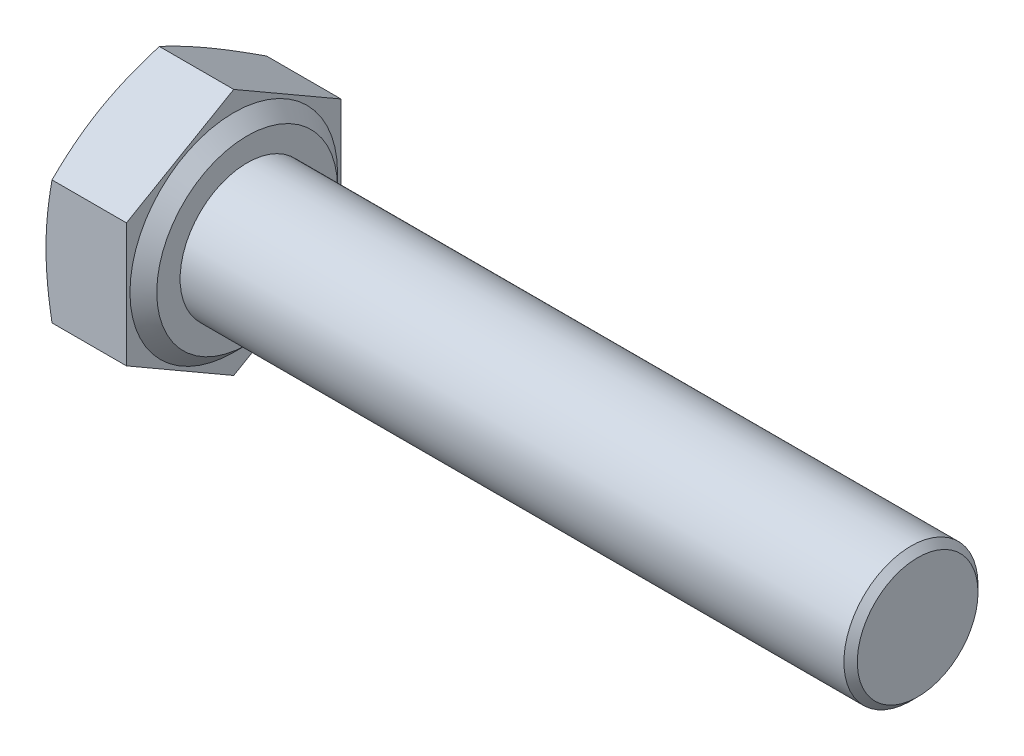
ISO-10303-21;
HEADER;
FILE_DESCRIPTION(('STEP AP214'),'2;1');
FILE_NAME('part.step','',(''),(''),'','','');
FILE_SCHEMA(('AUTOMOTIVE_DESIGN { 1 0 10303 214 1 1 1 1 }'));
ENDSEC;
DATA;
#1=APPLICATION_CONTEXT('core data for automotive mechanical design processes');
#2=APPLICATION_PROTOCOL_DEFINITION('international standard','automotive_design',2000,#1);
#3=PRODUCT_CONTEXT('',#1,'mechanical');
#4=PRODUCT('Part','Part','',(#3));
#5=PRODUCT_RELATED_PRODUCT_CATEGORY('part','',(#4));
#6=PRODUCT_DEFINITION_FORMATION('','',#4);
#7=PRODUCT_DEFINITION_CONTEXT('part definition',#1,'design');
#8=PRODUCT_DEFINITION('design','',#6,#7);
#9=PRODUCT_DEFINITION_SHAPE('','',#8);
#10=(LENGTH_UNIT() NAMED_UNIT(*) SI_UNIT(.MILLI.,.METRE.));
#11=(NAMED_UNIT(*) PLANE_ANGLE_UNIT() SI_UNIT($,.RADIAN.));
#12=(NAMED_UNIT(*) SI_UNIT($,.STERADIAN.) SOLID_ANGLE_UNIT());
#13=UNCERTAINTY_MEASURE_WITH_UNIT(LENGTH_MEASURE(1.E-05),#10,'distance_accuracy_value','');
#14=(GEOMETRIC_REPRESENTATION_CONTEXT(3) GLOBAL_UNCERTAINTY_ASSIGNED_CONTEXT((#13)) GLOBAL_UNIT_ASSIGNED_CONTEXT((#10,
#11,#12)) REPRESENTATION_CONTEXT('',''));
#15=CARTESIAN_POINT('',(0.,0.,0.));
#16=DIRECTION('',(0.,0.,1.));
#17=DIRECTION('',(1.,0.,0.));
#18=AXIS2_PLACEMENT_3D('',#15,#16,#17);
#19=CARTESIAN_POINT('',(3.5,-4.61880215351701,0.));
#20=DIRECTION('',(1.,0.,0.));
#21=DIRECTION('',(0.,0.,-1.));
#22=AXIS2_PLACEMENT_3D('',#19,#20,#21);
#23=PLANE('',#22);
#24=CARTESIAN_POINT('',(3.5,0.,0.));
#25=DIRECTION('',(-1.,0.,0.));
#26=DIRECTION('',(0.,0.,1.));
#27=AXIS2_PLACEMENT_3D('',#24,#25,#26);
#28=CIRCLE('',#27,3.37);
#29=CARTESIAN_POINT('',(3.5,0.,3.37));
#30=VERTEX_POINT('',#29);
#31=EDGE_CURVE('E254',#30,#30,#28,.T.);
#32=ORIENTED_EDGE('',*,*,#31,.F.);
#33=EDGE_LOOP('',(#32));
#34=FACE_BOUND('',#33,.T.);
#35=CARTESIAN_POINT('',(3.5,0.,0.));
#36=DIRECTION('',(1.,0.,0.));
#37=DIRECTION('',(0.,0.,-1.));
#38=AXIS2_PLACEMENT_3D('',#35,#36,#37);
#39=CIRCLE('',#38,2.5);
#40=CARTESIAN_POINT('',(3.5,0.,-2.5));
#41=VERTEX_POINT('',#40);
#42=EDGE_CURVE('E272',#41,#41,#39,.T.);
#43=ORIENTED_EDGE('',*,*,#42,.F.);
#44=EDGE_LOOP('',(#43));
#45=FACE_BOUND('',#44,.T.);
#46=ADVANCED_FACE('F32',(#34,#45),#23,.T.);
#47=CARTESIAN_POINT('',(3.5,-2.3094010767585,4.));
#48=DIRECTION('',(0.,0.866025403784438,-0.5));
#49=DIRECTION('',(0.,0.5,0.866025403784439));
#50=AXIS2_PLACEMENT_3D('',#47,#48,#49);
#51=PLANE('',#50);
#52=CARTESIAN_POINT('',(0.225267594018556,-4.61891762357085,-0.000199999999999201));
#53=CARTESIAN_POINT('',(0.190440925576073,-4.52327074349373,0.165465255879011));
#54=CARTESIAN_POINT('',(0.158759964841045,-4.42730844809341,0.331676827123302));
#55=CARTESIAN_POINT('',(0.103022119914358,-4.23475986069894,0.66518076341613));
#56=CARTESIAN_POINT('',(0.0789712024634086,-4.1381731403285,0.832473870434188));
#57=CARTESIAN_POINT('',(0.040069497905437,-3.9454476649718,1.16628418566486));
#58=CARTESIAN_POINT('',(0.0251338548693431,-3.84931331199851,1.33279376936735));
#59=CARTESIAN_POINT('',(0.00510095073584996,-3.65681977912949,1.66620234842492));
#60=CARTESIAN_POINT('',(0.,-3.56046069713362,1.83310117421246));
#61=CARTESIAN_POINT('',(0.,-3.36774253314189,2.16689882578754));
#62=CARTESIAN_POINT('',(0.00510095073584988,-3.27138345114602,2.33379765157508));
#63=CARTESIAN_POINT('',(0.025133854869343,-3.078889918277,2.66720623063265));
#64=CARTESIAN_POINT('',(0.0400694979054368,-2.98275556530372,2.83371581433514));
#65=CARTESIAN_POINT('',(0.0789712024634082,-2.79003008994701,3.16752612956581));
#66=CARTESIAN_POINT('',(0.103022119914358,-2.69344336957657,3.33481923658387));
#67=CARTESIAN_POINT('',(0.158759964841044,-2.5008947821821,3.6683231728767));
#68=CARTESIAN_POINT('',(0.190440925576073,-2.40493248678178,3.83453474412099));
#69=CARTESIAN_POINT('',(0.225267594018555,-2.30928560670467,4.0002));
#70=B_SPLINE_CURVE_WITH_KNOTS('',3,(#52,#53,#54,#55,#56,#57,#58,#59,#60,#61,#62,#63,#64,#65,#66,
#67,#68,#69),.UNSPECIFIED.,.F.,.F.,(4,2,2,2,2,2,2,2,4),(0.,0.583374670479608,1.16720442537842,
1.74551281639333,2.32360420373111,2.90169559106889,3.4800039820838,4.06383373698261,
4.64720840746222),.UNSPECIFIED.);
#71=CARTESIAN_POINT('',(0.225225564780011,-4.61880215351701,0.));
#72=VERTEX_POINT('',#71);
#73=CARTESIAN_POINT('',(0.,-3.46410161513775,2.));
#74=VERTEX_POINT('',#73);
#75=EDGE_CURVE('E166',#72,#74,#70,.T.);
#76=ORIENTED_EDGE('',*,*,#75,.F.);
#77=DIRECTION('',(-1.,0.,0.));
#78=VECTOR('',#77,1.);
#79=CARTESIAN_POINT('',(3.5,-4.61880215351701,0.));
#80=LINE('',#79,#78);
#81=CARTESIAN_POINT('',(3.,-4.61880215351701,0.));
#82=VERTEX_POINT('',#81);
#83=EDGE_CURVE('E141',#82,#72,#80,.T.);
#84=ORIENTED_EDGE('',*,*,#83,.F.);
#85=DIRECTION('',(0.,-0.5,-0.866025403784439));
#86=VECTOR('',#85,1.);
#87=CARTESIAN_POINT('',(3.,-2.3094010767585,4.));
#88=LINE('',#87,#86);
#89=CARTESIAN_POINT('',(3.,-2.3094010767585,4.));
#90=VERTEX_POINT('',#89);
#91=EDGE_CURVE('E132',#90,#82,#88,.T.);
#92=ORIENTED_EDGE('',*,*,#91,.F.);
#93=DIRECTION('',(-1.,0.,0.));
#94=VECTOR('',#93,1.);
#95=CARTESIAN_POINT('',(3.5,-2.3094010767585,4.));
#96=LINE('',#95,#94);
#97=CARTESIAN_POINT('',(0.225225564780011,-2.3094010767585,4.));
#98=VERTEX_POINT('',#97);
#99=EDGE_CURVE('E127',#90,#98,#96,.T.);
#100=ORIENTED_EDGE('',*,*,#99,.T.);
#101=EDGE_CURVE('E120',#74,#98,#70,.T.);
#102=ORIENTED_EDGE('',*,*,#101,.F.);
#103=EDGE_LOOP('',(#76,#84,#92,#100,#102));
#104=FACE_BOUND('',#103,.T.);
#105=ADVANCED_FACE('F229',(#104),#51,.F.);
#106=CARTESIAN_POINT('',(3.5,-4.61880215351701,0.));
#107=DIRECTION('',(0.,0.866025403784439,0.5));
#108=DIRECTION('',(0.,-0.5,0.866025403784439));
#109=AXIS2_PLACEMENT_3D('',#106,#107,#108);
#110=PLANE('',#109);
#111=CARTESIAN_POINT('',(0.225267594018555,-2.30928560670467,-4.0002));
#112=CARTESIAN_POINT('',(0.190440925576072,-2.40493248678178,-3.83453474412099));
#113=CARTESIAN_POINT('',(0.158759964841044,-2.50089478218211,-3.6683231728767));
#114=CARTESIAN_POINT('',(0.103022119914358,-2.69344336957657,-3.33481923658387));
#115=CARTESIAN_POINT('',(0.0789712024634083,-2.79003008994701,-3.16752612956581));
#116=CARTESIAN_POINT('',(0.0400694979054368,-2.98275556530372,-2.83371581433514));
#117=CARTESIAN_POINT('',(0.0251338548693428,-3.078889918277,-2.66720623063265));
#118=CARTESIAN_POINT('',(0.00510095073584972,-3.27138345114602,-2.33379765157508));
#119=CARTESIAN_POINT('',(0.,-3.36774253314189,-2.16689882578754));
#120=CARTESIAN_POINT('',(0.,-3.56046069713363,-1.83310117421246));
#121=CARTESIAN_POINT('',(0.00510095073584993,-3.65681977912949,-1.66620234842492));
#122=CARTESIAN_POINT('',(0.0251338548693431,-3.84931331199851,-1.33279376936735));
#123=CARTESIAN_POINT('',(0.0400694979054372,-3.9454476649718,-1.16628418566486));
#124=CARTESIAN_POINT('',(0.0789712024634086,-4.1381731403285,-0.832473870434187));
#125=CARTESIAN_POINT('',(0.103022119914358,-4.23475986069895,-0.665180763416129));
#126=CARTESIAN_POINT('',(0.158759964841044,-4.42730844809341,-0.331676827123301));
#127=CARTESIAN_POINT('',(0.190440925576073,-4.52327074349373,-0.16546525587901));
#128=CARTESIAN_POINT('',(0.225267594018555,-4.61891762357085,0.000200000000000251));
#129=B_SPLINE_CURVE_WITH_KNOTS('',3,(#111,#112,#113,#114,#115,#116,#117,#118,#119,#120,#121,
#122,#123,#124,#125,#126,#127,#128),.UNSPECIFIED.,.F.,.F.,(4,2,2,2,2,2,2,2,4),(0.,
0.583374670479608,1.16720442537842,1.74551281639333,2.32360420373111,2.90169559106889,
3.4800039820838,4.06383373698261,4.64720840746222),.UNSPECIFIED.);
#130=CARTESIAN_POINT('',(0.225225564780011,-2.3094010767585,-4.));
#131=VERTEX_POINT('',#130);
#132=CARTESIAN_POINT('',(0.,-3.46410161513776,-2.));
#133=VERTEX_POINT('',#132);
#134=EDGE_CURVE('E172',#131,#133,#129,.T.);
#135=ORIENTED_EDGE('',*,*,#134,.F.);
#136=DIRECTION('',(-1.,0.,0.));
#137=VECTOR('',#136,1.);
#138=CARTESIAN_POINT('',(3.5,-2.30940107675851,-4.));
#139=LINE('',#138,#137);
#140=CARTESIAN_POINT('',(3.,-2.3094010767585,-4.));
#141=VERTEX_POINT('',#140);
#142=EDGE_CURVE('E138',#141,#131,#139,.T.);
#143=ORIENTED_EDGE('',*,*,#142,.F.);
#144=DIRECTION('',(0.,0.5,-0.866025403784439));
#145=VECTOR('',#144,1.);
#146=CARTESIAN_POINT('',(3.,-4.61880215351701,0.));
#147=LINE('',#146,#145);
#148=EDGE_CURVE('E258',#82,#141,#147,.T.);
#149=ORIENTED_EDGE('',*,*,#148,.F.);
#150=ORIENTED_EDGE('',*,*,#83,.T.);
#151=EDGE_CURVE('E164',#133,#72,#129,.T.);
#152=ORIENTED_EDGE('',*,*,#151,.F.);
#153=EDGE_LOOP('',(#135,#143,#149,#150,#152));
#154=FACE_BOUND('',#153,.T.);
#155=ADVANCED_FACE('F181',(#154),#110,.F.);
#156=CARTESIAN_POINT('',(3.5,-2.30940107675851,-4.));
#157=DIRECTION('',(0.,0.,1.));
#158=DIRECTION('',(1.,0.,0.));
#159=AXIS2_PLACEMENT_3D('',#156,#157,#158);
#160=PLANE('',#159);
#161=CARTESIAN_POINT('',(1.20351609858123,-6.11448201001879,-4.));
#162=CARTESIAN_POINT('',(1.1484094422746,-5.93350754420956,-4.));
#163=CARTESIAN_POINT('',(1.0939458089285,-5.75233363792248,-4.));
#164=CARTESIAN_POINT('',(0.986660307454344,-5.38948540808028,-4.));
#165=CARTESIAN_POINT('',(0.933838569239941,-5.20781104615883,-4.));
#166=CARTESIAN_POINT('',(0.830104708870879,-4.84354941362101,-4.));
#167=CARTESIAN_POINT('',(0.779196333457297,-4.66096107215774,-4.));
#168=CARTESIAN_POINT('',(0.679885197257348,-4.29510518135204,-4.));
#169=CARTESIAN_POINT('',(0.631482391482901,-4.11183764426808,-4.));
#170=CARTESIAN_POINT('',(0.538379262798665,-3.74676129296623,-4.));
#171=CARTESIAN_POINT('',(0.493640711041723,-3.56496227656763,-4.));
#172=CARTESIAN_POINT('',(0.407974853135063,-3.20046880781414,-4.));
#173=CARTESIAN_POINT('',(0.367047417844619,-3.01777438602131,-4.));
#174=CARTESIAN_POINT('',(0.289954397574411,-2.65143543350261,-4.));
#175=CARTESIAN_POINT('',(0.253787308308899,-2.46779122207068,-4.));
#176=CARTESIAN_POINT('',(0.18731747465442,-2.09943661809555,-4.));
#177=CARTESIAN_POINT('',(0.157014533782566,-1.91472626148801,-4.));
#178=CARTESIAN_POINT('',(0.106503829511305,-1.5650339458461,-4.));
#179=CARTESIAN_POINT('',(0.0855452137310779,-1.40016146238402,-4.));
#180=CARTESIAN_POINT('',(0.0500684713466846,-1.06972842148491,-4.));
#181=CARTESIAN_POINT('',(0.0355498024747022,-0.904167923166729,-4.));
#182=CARTESIAN_POINT('',(0.0136501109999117,-0.572681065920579,-4.));
#183=CARTESIAN_POINT('',(0.00626423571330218,-0.406755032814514,-4.));
#184=CARTESIAN_POINT('',(-0.000995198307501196,-0.0747369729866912,-4.));
#185=CARTESIAN_POINT('',(-0.000868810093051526,0.091355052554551,-4.));
#186=CARTESIAN_POINT('',(0.00690897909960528,0.424202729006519,-4.));
#187=CARTESIAN_POINT('',(0.0145985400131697,0.590957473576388,-4.));
#188=CARTESIAN_POINT('',(0.0371492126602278,0.923977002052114,-4.));
#189=CARTESIAN_POINT('',(0.0520104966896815,1.09024177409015,-4.));
#190=CARTESIAN_POINT('',(0.0882078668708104,1.42220001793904,-4.));
#191=CARTESIAN_POINT('',(0.109549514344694,1.58789287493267,-4.));
#192=CARTESIAN_POINT('',(0.157847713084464,1.91844743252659,-4.));
#193=CARTESIAN_POINT('',(0.184804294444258,2.08330912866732,-4.));
#194=CARTESIAN_POINT('',(0.27584694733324,2.59401202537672,-4.));
#195=CARTESIAN_POINT('',(0.34803056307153,2.93840559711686,-4.));
#196=CARTESIAN_POINT('',(0.506289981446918,3.62399444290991,-4.));
#197=CARTESIAN_POINT('',(0.592370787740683,3.96518851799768,-4.));
#198=CARTESIAN_POINT('',(0.773793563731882,4.64555454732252,-4.));
#199=CARTESIAN_POINT('',(0.869147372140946,4.98472331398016,-4.));
#200=CARTESIAN_POINT('',(1.06598925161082,5.66119963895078,-4.));
#201=CARTESIAN_POINT('',(1.16747634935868,5.99850748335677,-4.));
#202=CARTESIAN_POINT('',(1.37355112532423,6.66809503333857,-4.));
#203=CARTESIAN_POINT('',(1.47809221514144,7.00038914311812,-4.));
#204=CARTESIAN_POINT('',(1.69014386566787,7.66404294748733,-4.));
#205=CARTESIAN_POINT('',(1.79765456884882,7.99540259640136,-4.));
#206=CARTESIAN_POINT('',(2.0144284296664,8.65615404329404,-4.));
#207=CARTESIAN_POINT('',(2.1236833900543,8.98554853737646,-4.));
#208=CARTESIAN_POINT('',(2.34383141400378,9.64375995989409,-4.));
#209=CARTESIAN_POINT('',(2.45472434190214,9.97257693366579,-4.));
#210=CARTESIAN_POINT('',(2.56619031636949,10.301196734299,-4.));
#211=B_SPLINE_CURVE_WITH_KNOTS('',3,(#161,#162,#163,#164,#165,#166,#167,#168,#169,#170,#171,
#172,#173,#174,#175,#176,#177,#178,#179,#180,#181,#182,#183,#184,#185,#186,#187,#188,#189,#190,
#191,#192,#193,#194,#195,#196,#197,#198,#199,#200,#201,#202,#203,#204,#205,#206,#207,#208,#209,
#210),.UNSPECIFIED.,.F.,.F.,(4,2,2,2,2,2,2,2,2,2,2,2,2,2,2,2,2,2,2,2,2,2,2,2,4),(0.,
0.567539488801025,1.13512376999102,1.70376702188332,2.27240006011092,2.83403638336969,
3.39565366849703,3.95709305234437,4.51851362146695,5.0170019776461,5.51544835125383,
6.01355537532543,6.51165888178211,7.01228852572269,7.51293019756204,8.01400273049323,
8.51507794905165,9.57019556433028,10.6256939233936,11.682557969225,12.7392547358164,
13.7842878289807,14.8293711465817,15.8704890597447,16.911521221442),.UNSPECIFIED.);
#212=CARTESIAN_POINT('',(0.225225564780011,2.30940107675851,-4.));
#213=VERTEX_POINT('',#212);
#214=CARTESIAN_POINT('',(0.,0.,-4.));
#215=VERTEX_POINT('',#214);
#216=EDGE_CURVE('E264',#213,#215,#211,.F.);
#217=ORIENTED_EDGE('',*,*,#216,.F.);
#218=DIRECTION('',(-1.,0.,0.));
#219=VECTOR('',#218,1.);
#220=CARTESIAN_POINT('',(3.5,2.3094010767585,-4.));
#221=LINE('',#220,#219);
#222=CARTESIAN_POINT('',(3.,2.30940107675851,-4.));
#223=VERTEX_POINT('',#222);
#224=EDGE_CURVE('E129',#223,#213,#221,.T.);
#225=ORIENTED_EDGE('',*,*,#224,.F.);
#226=DIRECTION('',(0.,1.,0.));
#227=VECTOR('',#226,1.);
#228=CARTESIAN_POINT('',(3.,-2.30940107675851,-4.));
#229=LINE('',#228,#227);
#230=EDGE_CURVE('E251',#141,#223,#229,.T.);
#231=ORIENTED_EDGE('',*,*,#230,.F.);
#232=ORIENTED_EDGE('',*,*,#142,.T.);
#233=EDGE_CURVE('E175',#215,#131,#211,.F.);
#234=ORIENTED_EDGE('',*,*,#233,.F.);
#235=EDGE_LOOP('',(#217,#225,#231,#232,#234));
#236=FACE_BOUND('',#235,.T.);
#237=ADVANCED_FACE('F237',(#236),#160,.F.);
#238=CARTESIAN_POINT('',(3.5,2.3094010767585,-4.));
#239=DIRECTION('',(0.,-0.866025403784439,0.5));
#240=DIRECTION('',(0.,-0.5,-0.866025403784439));
#241=AXIS2_PLACEMENT_3D('',#238,#239,#240);
#242=PLANE('',#241);
#243=CARTESIAN_POINT('',(0.225267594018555,4.61891762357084,0.000199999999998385));
#244=CARTESIAN_POINT('',(0.190440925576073,4.52327074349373,-0.165465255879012));
#245=CARTESIAN_POINT('',(0.158759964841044,4.42730844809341,-0.331676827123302));
#246=CARTESIAN_POINT('',(0.103022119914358,4.23475986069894,-0.665180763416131));
#247=CARTESIAN_POINT('',(0.0789712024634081,4.1381731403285,-0.832473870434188));
#248=CARTESIAN_POINT('',(0.0400694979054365,3.9454476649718,-1.16628418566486));
#249=CARTESIAN_POINT('',(0.0251338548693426,3.84931331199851,-1.33279376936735));
#250=CARTESIAN_POINT('',(0.00510095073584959,3.65681977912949,-1.66620234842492));
#251=CARTESIAN_POINT('',(0.,3.56046069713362,-1.83310117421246));
#252=CARTESIAN_POINT('',(0.,3.36774253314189,-2.16689882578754));
#253=CARTESIAN_POINT('',(0.00510095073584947,3.27138345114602,-2.33379765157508));
#254=CARTESIAN_POINT('',(0.0251338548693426,3.078889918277,-2.66720623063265));
#255=CARTESIAN_POINT('',(0.0400694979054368,2.98275556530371,-2.83371581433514));
#256=CARTESIAN_POINT('',(0.0789712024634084,2.79003008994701,-3.16752612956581));
#257=CARTESIAN_POINT('',(0.103022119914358,2.69344336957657,-3.33481923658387));
#258=CARTESIAN_POINT('',(0.158759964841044,2.5008947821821,-3.6683231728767));
#259=CARTESIAN_POINT('',(0.190440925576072,2.40493248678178,-3.83453474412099));
#260=CARTESIAN_POINT('',(0.225267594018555,2.30928560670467,-4.0002));
#261=B_SPLINE_CURVE_WITH_KNOTS('',3,(#243,#244,#245,#246,#247,#248,#249,#250,#251,#252,#253,
#254,#255,#256,#257,#258,#259,#260),.UNSPECIFIED.,.F.,.F.,(4,2,2,2,2,2,2,2,4),(0.,
0.583374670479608,1.16720442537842,1.74551281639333,2.32360420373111,2.90169559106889,
3.4800039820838,4.06383373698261,4.64720840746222),.UNSPECIFIED.);
#262=CARTESIAN_POINT('',(0.225225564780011,4.61880215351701,0.));
#263=VERTEX_POINT('',#262);
#264=CARTESIAN_POINT('',(0.,3.46410161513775,-2.));
#265=VERTEX_POINT('',#264);
#266=EDGE_CURVE('E47',#263,#265,#261,.T.);
#267=ORIENTED_EDGE('',*,*,#266,.F.);
#268=DIRECTION('',(-1.,0.,0.));
#269=VECTOR('',#268,1.);
#270=CARTESIAN_POINT('',(3.5,4.61880215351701,0.));
#271=LINE('',#270,#269);
#272=CARTESIAN_POINT('',(3.,4.61880215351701,0.));
#273=VERTEX_POINT('',#272);
#274=EDGE_CURVE('E126',#273,#263,#271,.T.);
#275=ORIENTED_EDGE('',*,*,#274,.F.);
#276=DIRECTION('',(0.,0.5,0.866025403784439));
#277=VECTOR('',#276,1.);
#278=CARTESIAN_POINT('',(3.,2.3094010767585,-4.));
#279=LINE('',#278,#277);
#280=EDGE_CURVE('E248',#223,#273,#279,.T.);
#281=ORIENTED_EDGE('',*,*,#280,.F.);
#282=ORIENTED_EDGE('',*,*,#224,.T.);
#283=EDGE_CURVE('E178',#265,#213,#261,.T.);
#284=ORIENTED_EDGE('',*,*,#283,.F.);
#285=EDGE_LOOP('',(#267,#275,#281,#282,#284));
#286=FACE_BOUND('',#285,.T.);
#287=ADVANCED_FACE('F244',(#286),#242,.F.);
#288=CARTESIAN_POINT('',(3.5,4.61880215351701,0.));
#289=DIRECTION('',(0.,-0.866025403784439,-0.5));
#290=DIRECTION('',(0.,0.5,-0.866025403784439));
#291=AXIS2_PLACEMENT_3D('',#288,#289,#290);
#292=PLANE('',#291);
#293=CARTESIAN_POINT('',(0.225267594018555,2.30928560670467,4.0002));
#294=CARTESIAN_POINT('',(0.190440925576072,2.40493248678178,3.83453474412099));
#295=CARTESIAN_POINT('',(0.158759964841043,2.5008947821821,3.6683231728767));
#296=CARTESIAN_POINT('',(0.103022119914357,2.69344336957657,3.33481923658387));
#297=CARTESIAN_POINT('',(0.078971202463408,2.79003008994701,3.16752612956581));
#298=CARTESIAN_POINT('',(0.0400694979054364,2.98275556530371,2.83371581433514));
#299=CARTESIAN_POINT('',(0.0251338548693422,3.078889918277,2.66720623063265));
#300=CARTESIAN_POINT('',(0.00510095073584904,3.27138345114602,2.33379765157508));
#301=CARTESIAN_POINT('',(0.,3.36774253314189,2.16689882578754));
#302=CARTESIAN_POINT('',(0.,3.56046069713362,1.83310117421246));
#303=CARTESIAN_POINT('',(0.00510095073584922,3.65681977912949,1.66620234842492));
#304=CARTESIAN_POINT('',(0.0251338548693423,3.84931331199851,1.33279376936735));
#305=CARTESIAN_POINT('',(0.0400694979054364,3.9454476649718,1.16628418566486));
#306=CARTESIAN_POINT('',(0.0789712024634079,4.1381731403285,0.832473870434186));
#307=CARTESIAN_POINT('',(0.103022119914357,4.23475986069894,0.665180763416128));
#308=CARTESIAN_POINT('',(0.158759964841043,4.42730844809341,0.3316768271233));
#309=CARTESIAN_POINT('',(0.190440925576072,4.52327074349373,0.165465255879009));
#310=CARTESIAN_POINT('',(0.225267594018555,4.61891762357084,-0.000200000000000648));
#311=B_SPLINE_CURVE_WITH_KNOTS('',3,(#293,#294,#295,#296,#297,#298,#299,#300,#301,#302,#303,
#304,#305,#306,#307,#308,#309,#310),.UNSPECIFIED.,.F.,.F.,(4,2,2,2,2,2,2,2,4),(0.,
0.583374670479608,1.16720442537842,1.74551281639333,2.32360420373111,2.90169559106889,
3.4800039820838,4.06383373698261,4.64720840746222),.UNSPECIFIED.);
#312=CARTESIAN_POINT('',(0.225225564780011,2.3094010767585,4.));
#313=VERTEX_POINT('',#312);
#314=CARTESIAN_POINT('',(0.,3.46410161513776,2.));
#315=VERTEX_POINT('',#314);
#316=EDGE_CURVE('E55',#313,#315,#311,.T.);
#317=ORIENTED_EDGE('',*,*,#316,.F.);
#318=DIRECTION('',(-1.,0.,0.));
#319=VECTOR('',#318,1.);
#320=CARTESIAN_POINT('',(3.5,2.3094010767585,4.));
#321=LINE('',#320,#319);
#322=CARTESIAN_POINT('',(3.,2.3094010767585,4.));
#323=VERTEX_POINT('',#322);
#324=EDGE_CURVE('E117',#323,#313,#321,.T.);
#325=ORIENTED_EDGE('',*,*,#324,.F.);
#326=DIRECTION('',(0.,-0.5,0.866025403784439));
#327=VECTOR('',#326,1.);
#328=CARTESIAN_POINT('',(3.,4.61880215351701,0.));
#329=LINE('',#328,#327);
#330=EDGE_CURVE('E246',#273,#323,#329,.T.);
#331=ORIENTED_EDGE('',*,*,#330,.F.);
#332=ORIENTED_EDGE('',*,*,#274,.T.);
#333=EDGE_CURVE('E119',#315,#263,#311,.T.);
#334=ORIENTED_EDGE('',*,*,#333,.F.);
#335=EDGE_LOOP('',(#317,#325,#331,#332,#334));
#336=FACE_BOUND('',#335,.T.);
#337=ADVANCED_FACE('F115',(#336),#292,.F.);
#338=CARTESIAN_POINT('',(3.5,2.3094010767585,4.));
#339=DIRECTION('',(0.,0.,-1.));
#340=DIRECTION('',(0.,1.,0.));
#341=AXIS2_PLACEMENT_3D('',#338,#339,#340);
#342=PLANE('',#341);
#343=CARTESIAN_POINT('',(1.20351631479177,-6.11448271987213,4.));
#344=CARTESIAN_POINT('',(1.14840964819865,-5.93350822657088,4.));
#345=CARTESIAN_POINT('',(1.09394600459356,-5.75233429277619,4.));
#346=CARTESIAN_POINT('',(0.98666048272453,-5.38948600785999,4.));
#347=CARTESIAN_POINT('',(0.933838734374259,-5.20781161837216,4.));
#348=CARTESIAN_POINT('',(0.830104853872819,-4.84354993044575,4.));
#349=CARTESIAN_POINT('',(0.779196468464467,-4.66096156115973,4.));
#350=CARTESIAN_POINT('',(0.679885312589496,-4.29510561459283,4.));
#351=CARTESIAN_POINT('',(0.631482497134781,-4.11183804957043,4.));
#352=CARTESIAN_POINT('',(0.538379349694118,-3.74676164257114,4.));
#353=CARTESIAN_POINT('',(0.493640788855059,-3.56496259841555,4.));
#354=CARTESIAN_POINT('',(0.407974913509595,-3.20046907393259,4.));
#355=CARTESIAN_POINT('',(0.3670474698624,-3.01777462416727,4.));
#356=CARTESIAN_POINT('',(0.289954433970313,-2.65143561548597,4.));
#357=CARTESIAN_POINT('',(0.253787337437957,-2.46779137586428,4.));
#358=CARTESIAN_POINT('',(0.187317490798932,-2.09943671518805,4.));
#359=CARTESIAN_POINT('',(0.157014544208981,-1.91472633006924,4.));
#360=CARTESIAN_POINT('',(0.106503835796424,-1.565033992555,4.));
#361=CARTESIAN_POINT('',(0.0855452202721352,-1.40016151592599,4.));
#362=CARTESIAN_POINT('',(0.0500684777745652,-1.06972848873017,4.));
#363=CARTESIAN_POINT('',(0.0355498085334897,-0.904167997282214,4.));
#364=CARTESIAN_POINT('',(0.0136501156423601,-0.572681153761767,4.));
#365=CARTESIAN_POINT('',(0.00626423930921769,-0.406755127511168,4.));
#366=CARTESIAN_POINT('',(-0.000995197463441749,-0.0747370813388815,4.));
#367=CARTESIAN_POINT('',(-0.000868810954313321,0.0913549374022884,4.));
#368=CARTESIAN_POINT('',(0.00690897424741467,0.424202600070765,4.));
#369=CARTESIAN_POINT('',(0.0145985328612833,0.590957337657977,4.));
#370=CARTESIAN_POINT('',(0.0371492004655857,0.923976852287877,4.));
#371=CARTESIAN_POINT('',(0.0520104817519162,1.09024161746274,4.));
#372=CARTESIAN_POINT('',(0.0882078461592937,1.42219984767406,4.));
#373=CARTESIAN_POINT('',(0.109549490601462,1.58789269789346,4.));
#374=CARTESIAN_POINT('',(0.157847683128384,1.91844724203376,4.));
#375=CARTESIAN_POINT('',(0.184804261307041,2.0833089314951,4.));
#376=CARTESIAN_POINT('',(0.275846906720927,2.59401182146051,4.));
#377=CARTESIAN_POINT('',(0.348030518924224,2.93840539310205,4.));
#378=CARTESIAN_POINT('',(0.506289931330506,3.62399423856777,4.));
#379=CARTESIAN_POINT('',(0.592370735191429,3.96518831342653,4.));
#380=CARTESIAN_POINT('',(0.773793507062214,4.64555434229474,4.));
#381=CARTESIAN_POINT('',(0.869147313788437,4.98472310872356,4.));
#382=CARTESIAN_POINT('',(1.06598919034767,5.66119943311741,4.));
#383=CARTESIAN_POINT('',(1.16747628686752,5.99850727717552,4.));
#384=CARTESIAN_POINT('',(1.37355106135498,6.66809482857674,4.));
#385=CARTESIAN_POINT('',(1.47809215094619,7.00038894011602,4.));
#386=CARTESIAN_POINT('',(1.69014380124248,7.66404274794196,4.));
#387=CARTESIAN_POINT('',(1.79765450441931,7.99540239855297,4.));
#388=CARTESIAN_POINT('',(2.01442836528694,8.6561538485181,4.));
#389=CARTESIAN_POINT('',(2.12368332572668,8.98554834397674,4.));
#390=CARTESIAN_POINT('',(2.34383134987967,9.64375976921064,4.));
#391=CARTESIAN_POINT('',(2.45472427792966,9.97257674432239,4.));
#392=CARTESIAN_POINT('',(2.56619025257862,10.3011965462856,4.));
#393=B_SPLINE_CURVE_WITH_KNOTS('',3,(#343,#344,#345,#346,#347,#348,#349,#350,#351,#352,#353,
#354,#355,#356,#357,#358,#359,#360,#361,#362,#363,#364,#365,#366,#367,#368,#369,#370,#371,#372,
#373,#374,#375,#376,#377,#378,#379,#380,#381,#382,#383,#384,#385,#386,#387,#388,#389,#390,#391,
#392),.UNSPECIFIED.,.F.,.F.,(4,2,2,2,2,2,2,2,2,2,2,2,2,2,2,2,2,2,2,2,2,2,2,2,4),(0.,
0.567539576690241,1.13512394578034,1.70376728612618,2.27240041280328,2.83403682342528,
3.39565419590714,3.95709366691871,4.51851432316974,5.01700265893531,5.51544901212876,
6.01355601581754,6.51165950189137,7.01228912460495,7.51293077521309,8.01400328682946,
8.51507848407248,9.57019609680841,10.6256944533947,11.6825584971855,12.7392552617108,
13.7842883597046,14.8293716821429,15.870489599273,16.9115217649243),.UNSPECIFIED.);
#394=CARTESIAN_POINT('',(0.,0.,4.));
#395=VERTEX_POINT('',#394);
#396=EDGE_CURVE('E110',#98,#395,#393,.T.);
#397=ORIENTED_EDGE('',*,*,#396,.F.);
#398=ORIENTED_EDGE('',*,*,#99,.F.);
#399=DIRECTION('',(0.,-1.,0.));
#400=VECTOR('',#399,1.);
#401=CARTESIAN_POINT('',(3.,2.3094010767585,4.));
#402=LINE('',#401,#400);
#403=EDGE_CURVE('E125',#323,#90,#402,.T.);
#404=ORIENTED_EDGE('',*,*,#403,.F.);
#405=ORIENTED_EDGE('',*,*,#324,.T.);
#406=EDGE_CURVE('E102',#395,#313,#393,.T.);
#407=ORIENTED_EDGE('',*,*,#406,.F.);
#408=EDGE_LOOP('',(#397,#398,#404,#405,#407));
#409=FACE_BOUND('',#408,.T.);
#410=ADVANCED_FACE('F123',(#409),#342,.F.);
#411=CARTESIAN_POINT('',(3.,3.87000000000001,0.));
#412=DIRECTION('',(1.,0.,0.));
#413=DIRECTION('',(0.,0.,-1.));
#414=AXIS2_PLACEMENT_3D('',#411,#412,#413);
#415=PLANE('',#414);
#416=CARTESIAN_POINT('',(3.,0.,0.));
#417=DIRECTION('',(-1.,0.,0.));
#418=DIRECTION('',(0.,0.,1.));
#419=AXIS2_PLACEMENT_3D('',#416,#417,#418);
#420=CIRCLE('',#419,3.87000000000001);
#421=CARTESIAN_POINT('',(3.,0.,3.87000000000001));
#422=VERTEX_POINT('',#421);
#423=EDGE_CURVE('E249',#422,#422,#420,.T.);
#424=ORIENTED_EDGE('',*,*,#423,.T.);
#425=EDGE_LOOP('',(#424));
#426=FACE_BOUND('',#425,.T.);
#427=ORIENTED_EDGE('',*,*,#91,.T.);
#428=ORIENTED_EDGE('',*,*,#148,.T.);
#429=ORIENTED_EDGE('',*,*,#230,.T.);
#430=ORIENTED_EDGE('',*,*,#280,.T.);
#431=ORIENTED_EDGE('',*,*,#330,.T.);
#432=ORIENTED_EDGE('',*,*,#403,.T.);
#433=EDGE_LOOP('',(#427,#428,#429,#430,#431,#432));
#434=FACE_BOUND('',#433,.T.);
#435=ADVANCED_FACE('F259',(#426,#434),#415,.T.);
#436=CARTESIAN_POINT('',(3.,0.,0.));
#437=DIRECTION('',(-1.,0.,0.));
#438=DIRECTION('',(0.,0.,1.));
#439=AXIS2_PLACEMENT_3D('',#436,#437,#438);
#440=CONICAL_SURFACE('',#439,3.87000000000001,0.785398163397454);
#441=ORIENTED_EDGE('',*,*,#31,.T.);
#442=EDGE_LOOP('',(#441));
#443=FACE_BOUND('',#442,.T.);
#444=ORIENTED_EDGE('',*,*,#423,.F.);
#445=EDGE_LOOP('',(#444));
#446=FACE_BOUND('',#445,.T.);
#447=ADVANCED_FACE('F210',(#443,#446),#440,.T.);
#448=CARTESIAN_POINT('',(0.,0.,0.));
#449=DIRECTION('',(1.,0.,0.));
#450=DIRECTION('',(0.,0.,-1.));
#451=AXIS2_PLACEMENT_3D('',#448,#449,#450);
#452=CONICAL_SURFACE('',#451,4.,1.22173047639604);
#453=ORIENTED_EDGE('',*,*,#233,.T.);
#454=ORIENTED_EDGE('',*,*,#134,.T.);
#455=CARTESIAN_POINT('',(0.,0.,0.));
#456=DIRECTION('',(1.,0.,0.));
#457=DIRECTION('',(0.,0.,-1.));
#458=AXIS2_PLACEMENT_3D('',#455,#456,#457);
#459=CIRCLE('',#458,4.);
#460=EDGE_CURVE('E145',#133,#215,#459,.T.);
#461=ORIENTED_EDGE('',*,*,#460,.T.);
#462=EDGE_LOOP('',(#453,#454,#461));
#463=FACE_BOUND('',#462,.T.);
#464=ADVANCED_FACE('F173',(#463),#452,.T.);
#465=ORIENTED_EDGE('',*,*,#151,.T.);
#466=ORIENTED_EDGE('',*,*,#75,.T.);
#467=EDGE_CURVE('E147',#74,#133,#459,.T.);
#468=ORIENTED_EDGE('',*,*,#467,.T.);
#469=EDGE_LOOP('',(#465,#466,#468));
#470=FACE_BOUND('',#469,.T.);
#471=ADVANCED_FACE('F162',(#470),#452,.T.);
#472=ORIENTED_EDGE('',*,*,#101,.T.);
#473=ORIENTED_EDGE('',*,*,#396,.T.);
#474=EDGE_CURVE('E156',#395,#74,#459,.T.);
#475=ORIENTED_EDGE('',*,*,#474,.T.);
#476=EDGE_LOOP('',(#472,#473,#475));
#477=FACE_BOUND('',#476,.T.);
#478=ADVANCED_FACE('F328',(#477),#452,.T.);
#479=ORIENTED_EDGE('',*,*,#316,.T.);
#480=CARTESIAN_POINT('',(0.,0.,0.));
#481=DIRECTION('',(-1.,0.,0.));
#482=DIRECTION('',(0.,0.,1.));
#483=AXIS2_PLACEMENT_3D('',#480,#481,#482);
#484=CIRCLE('',#483,4.);
#485=EDGE_CURVE('E105',#395,#315,#484,.T.);
#486=ORIENTED_EDGE('',*,*,#485,.F.);
#487=ORIENTED_EDGE('',*,*,#406,.T.);
#488=EDGE_LOOP('',(#479,#486,#487));
#489=FACE_BOUND('',#488,.T.);
#490=ADVANCED_FACE('F103',(#489),#452,.T.);
#491=ORIENTED_EDGE('',*,*,#266,.T.);
#492=EDGE_CURVE('E152',#265,#315,#459,.T.);
#493=ORIENTED_EDGE('',*,*,#492,.T.);
#494=ORIENTED_EDGE('',*,*,#333,.T.);
#495=EDGE_LOOP('',(#491,#493,#494));
#496=FACE_BOUND('',#495,.T.);
#497=ADVANCED_FACE('F207',(#496),#452,.T.);
#498=ORIENTED_EDGE('',*,*,#216,.T.);
#499=EDGE_CURVE('E148',#215,#265,#459,.T.);
#500=ORIENTED_EDGE('',*,*,#499,.T.);
#501=ORIENTED_EDGE('',*,*,#283,.T.);
#502=EDGE_LOOP('',(#498,#500,#501));
#503=FACE_BOUND('',#502,.T.);
#504=ADVANCED_FACE('F202',(#503),#452,.T.);
#505=CARTESIAN_POINT('',(0.,-4.61880215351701,0.));
#506=DIRECTION('',(1.,0.,0.));
#507=DIRECTION('',(0.,0.,-1.));
#508=AXIS2_PLACEMENT_3D('',#505,#506,#507);
#509=PLANE('',#508);
#510=ORIENTED_EDGE('',*,*,#499,.F.);
#511=ORIENTED_EDGE('',*,*,#460,.F.);
#512=ORIENTED_EDGE('',*,*,#467,.F.);
#513=ORIENTED_EDGE('',*,*,#474,.F.);
#514=ORIENTED_EDGE('',*,*,#485,.T.);
#515=ORIENTED_EDGE('',*,*,#492,.F.);
#516=EDGE_LOOP('',(#510,#511,#512,#513,#514,#515));
#517=FACE_BOUND('',#516,.T.);
#518=ADVANCED_FACE('F180',(#517),#509,.F.);
#519=CARTESIAN_POINT('',(28.5,0.,0.));
#520=DIRECTION('',(-1.,0.,0.));
#521=DIRECTION('',(0.,0.,1.));
#522=AXIS2_PLACEMENT_3D('',#519,#520,#521);
#523=CYLINDRICAL_SURFACE('',#522,2.5);
#524=CARTESIAN_POINT('',(28.25,0.,0.));
#525=DIRECTION('',(1.,0.,0.));
#526=DIRECTION('',(0.,0.,-1.));
#527=AXIS2_PLACEMENT_3D('',#524,#525,#526);
#528=CIRCLE('',#527,2.5);
#529=CARTESIAN_POINT('',(28.25,0.,-2.5));
#530=VERTEX_POINT('',#529);
#531=EDGE_CURVE('E11',#530,#530,#528,.F.);
#532=ORIENTED_EDGE('',*,*,#531,.T.);
#533=EDGE_LOOP('',(#532));
#534=FACE_BOUND('',#533,.T.);
#535=ORIENTED_EDGE('',*,*,#42,.T.);
#536=EDGE_LOOP('',(#535));
#537=FACE_BOUND('',#536,.T.);
#538=ADVANCED_FACE('F208',(#534,#537),#523,.T.);
#539=CARTESIAN_POINT('',(28.5,0.,0.));
#540=DIRECTION('',(1.,0.,0.));
#541=DIRECTION('',(0.,0.,-1.));
#542=AXIS2_PLACEMENT_3D('',#539,#540,#541);
#543=PLANE('',#542);
#544=CARTESIAN_POINT('',(28.5,0.,0.));
#545=DIRECTION('',(1.,0.,0.));
#546=DIRECTION('',(0.,0.,-1.));
#547=AXIS2_PLACEMENT_3D('',#544,#545,#546);
#548=CIRCLE('',#547,2.25000000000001);
#549=CARTESIAN_POINT('',(28.5,0.,-2.25000000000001));
#550=VERTEX_POINT('',#549);
#551=EDGE_CURVE('E40',#550,#550,#548,.T.);
#552=ORIENTED_EDGE('',*,*,#551,.T.);
#553=EDGE_LOOP('',(#552));
#554=FACE_BOUND('',#553,.T.);
#555=ADVANCED_FACE('F276',(#554),#543,.T.);
#556=CARTESIAN_POINT('',(28.5,0.,0.));
#557=DIRECTION('',(-1.,0.,0.));
#558=DIRECTION('',(0.,0.,1.));
#559=AXIS2_PLACEMENT_3D('',#556,#557,#558);
#560=CONICAL_SURFACE('',#559,2.25000000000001,0.785398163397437);
#561=ORIENTED_EDGE('',*,*,#531,.F.);
#562=EDGE_LOOP('',(#561));
#563=FACE_BOUND('',#562,.T.);
#564=ORIENTED_EDGE('',*,*,#551,.F.);
#565=EDGE_LOOP('',(#564));
#566=FACE_BOUND('',#565,.T.);
#567=ADVANCED_FACE('F34',(#563,#566),#560,.T.);
#568=CLOSED_SHELL('',(#46,#105,#155,#237,#287,#337,#410,#435,#447,#464,#471,#478,#490,#497,#504,
#518,#538,#555,#567));
#569=MANIFOLD_SOLID_BREP('B2',#568);
#570=ADVANCED_BREP_SHAPE_REPRESENTATION('',(#18,#569),#14);
#571=SHAPE_DEFINITION_REPRESENTATION(#9,#570);
ENDSEC;
END-ISO-10303-21;
